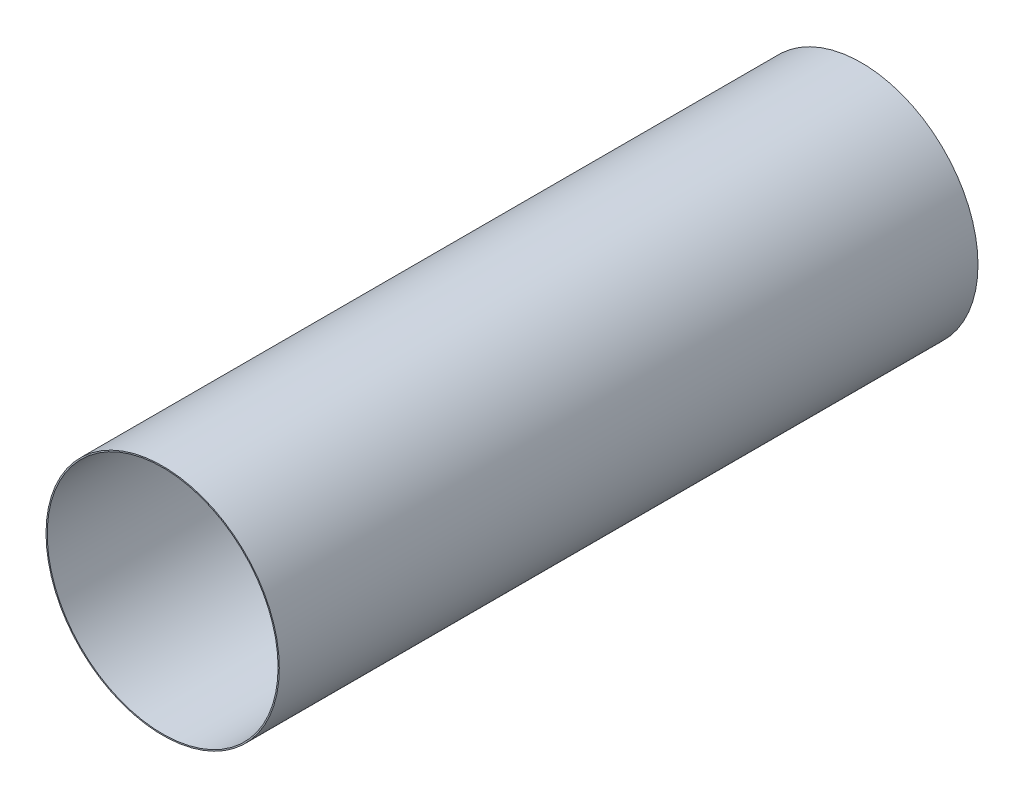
ISO-10303-21;
HEADER;
FILE_DESCRIPTION(('STEP AP214'),'2;1');
FILE_NAME('part.step','',(''),(''),'','','');
FILE_SCHEMA(('AUTOMOTIVE_DESIGN { 1 0 10303 214 1 1 1 1 }'));
ENDSEC;
DATA;
#1=APPLICATION_CONTEXT('core data for automotive mechanical design processes');
#2=APPLICATION_PROTOCOL_DEFINITION('international standard','automotive_design',2000,#1);
#3=PRODUCT_CONTEXT('',#1,'mechanical');
#4=PRODUCT('Part','Part','',(#3));
#5=PRODUCT_RELATED_PRODUCT_CATEGORY('part','',(#4));
#6=PRODUCT_DEFINITION_FORMATION('','',#4);
#7=PRODUCT_DEFINITION_CONTEXT('part definition',#1,'design');
#8=PRODUCT_DEFINITION('design','',#6,#7);
#9=PRODUCT_DEFINITION_SHAPE('','',#8);
#10=(LENGTH_UNIT() NAMED_UNIT(*) SI_UNIT(.MILLI.,.METRE.));
#11=(NAMED_UNIT(*) PLANE_ANGLE_UNIT() SI_UNIT($,.RADIAN.));
#12=(NAMED_UNIT(*) SI_UNIT($,.STERADIAN.) SOLID_ANGLE_UNIT());
#13=UNCERTAINTY_MEASURE_WITH_UNIT(LENGTH_MEASURE(1.E-05),#10,'distance_accuracy_value','');
#14=(GEOMETRIC_REPRESENTATION_CONTEXT(3) GLOBAL_UNCERTAINTY_ASSIGNED_CONTEXT((#13)) GLOBAL_UNIT_ASSIGNED_CONTEXT((#10,
#11,#12)) REPRESENTATION_CONTEXT('',''));
#15=CARTESIAN_POINT('',(0.,0.,0.));
#16=DIRECTION('',(0.,0.,1.));
#17=DIRECTION('',(1.,0.,0.));
#18=AXIS2_PLACEMENT_3D('',#15,#16,#17);
#19=CARTESIAN_POINT('',(0.,0.,-115.));
#20=DIRECTION('',(0.,0.,1.));
#21=DIRECTION('',(1.,0.,0.));
#22=AXIS2_PLACEMENT_3D('',#19,#20,#21);
#23=CYLINDRICAL_SURFACE('',#22,19.2);
#24=CARTESIAN_POINT('',(0.,0.,-115.));
#25=DIRECTION('',(0.,0.,1.));
#26=DIRECTION('',(1.,0.,0.));
#27=AXIS2_PLACEMENT_3D('',#24,#25,#26);
#28=CIRCLE('',#27,19.2);
#29=CARTESIAN_POINT('',(19.2,0.,-115.));
#30=VERTEX_POINT('',#29);
#31=EDGE_CURVE('E10',#30,#30,#28,.T.);
#32=ORIENTED_EDGE('',*,*,#31,.T.);
#33=EDGE_LOOP('',(#32));
#34=FACE_BOUND('',#33,.T.);
#35=CARTESIAN_POINT('',(0.,0.,0.));
#36=DIRECTION('',(0.,0.,1.));
#37=DIRECTION('',(1.,0.,0.));
#38=AXIS2_PLACEMENT_3D('',#35,#36,#37);
#39=CIRCLE('',#38,19.2);
#40=CARTESIAN_POINT('',(19.2,0.,0.));
#41=VERTEX_POINT('',#40);
#42=EDGE_CURVE('E40',#41,#41,#39,.T.);
#43=ORIENTED_EDGE('',*,*,#42,.F.);
#44=EDGE_LOOP('',(#43));
#45=FACE_BOUND('',#44,.T.);
#46=ADVANCED_FACE('F37',(#34,#45),#23,.T.);
#47=CARTESIAN_POINT('',(0.,0.,-115.));
#48=DIRECTION('',(0.,0.,1.));
#49=DIRECTION('',(1.,0.,0.));
#50=AXIS2_PLACEMENT_3D('',#47,#48,#49);
#51=PLANE('',#50);
#52=CARTESIAN_POINT('',(0.,0.,-115.));
#53=DIRECTION('',(0.,0.,1.));
#54=DIRECTION('',(1.,0.,0.));
#55=AXIS2_PLACEMENT_3D('',#52,#53,#54);
#56=CIRCLE('',#55,19.);
#57=CARTESIAN_POINT('',(19.,0.,-115.));
#58=VERTEX_POINT('',#57);
#59=EDGE_CURVE('E47',#58,#58,#56,.T.);
#60=ORIENTED_EDGE('',*,*,#59,.T.);
#61=EDGE_LOOP('',(#60));
#62=FACE_BOUND('',#61,.T.);
#63=ORIENTED_EDGE('',*,*,#31,.F.);
#64=EDGE_LOOP('',(#63));
#65=FACE_BOUND('',#64,.T.);
#66=ADVANCED_FACE('F55',(#62,#65),#51,.F.);
#67=CARTESIAN_POINT('',(0.,0.,0.));
#68=DIRECTION('',(0.,0.,1.));
#69=DIRECTION('',(1.,0.,0.));
#70=AXIS2_PLACEMENT_3D('',#67,#68,#69);
#71=PLANE('',#70);
#72=CARTESIAN_POINT('',(0.,0.,0.));
#73=DIRECTION('',(0.,0.,1.));
#74=DIRECTION('',(1.,0.,0.));
#75=AXIS2_PLACEMENT_3D('',#72,#73,#74);
#76=CIRCLE('',#75,19.);
#77=CARTESIAN_POINT('',(19.,0.,0.));
#78=VERTEX_POINT('',#77);
#79=EDGE_CURVE('E49',#78,#78,#76,.T.);
#80=ORIENTED_EDGE('',*,*,#79,.F.);
#81=EDGE_LOOP('',(#80));
#82=FACE_BOUND('',#81,.T.);
#83=ORIENTED_EDGE('',*,*,#42,.T.);
#84=EDGE_LOOP('',(#83));
#85=FACE_BOUND('',#84,.T.);
#86=ADVANCED_FACE('F61',(#82,#85),#71,.T.);
#87=CARTESIAN_POINT('',(0.,0.,-115.));
#88=DIRECTION('',(0.,0.,1.));
#89=DIRECTION('',(1.,0.,0.));
#90=AXIS2_PLACEMENT_3D('',#87,#88,#89);
#91=CYLINDRICAL_SURFACE('',#90,19.);
#92=ORIENTED_EDGE('',*,*,#59,.F.);
#93=EDGE_LOOP('',(#92));
#94=FACE_BOUND('',#93,.T.);
#95=ORIENTED_EDGE('',*,*,#79,.T.);
#96=EDGE_LOOP('',(#95));
#97=FACE_BOUND('',#96,.T.);
#98=ADVANCED_FACE('F58',(#94,#97),#91,.F.);
#99=CLOSED_SHELL('',(#46,#66,#86,#98));
#100=MANIFOLD_SOLID_BREP('B2',#99);
#101=ADVANCED_BREP_SHAPE_REPRESENTATION('',(#18,#100),#14);
#102=SHAPE_DEFINITION_REPRESENTATION(#9,#101);
ENDSEC;
END-ISO-10303-21;
